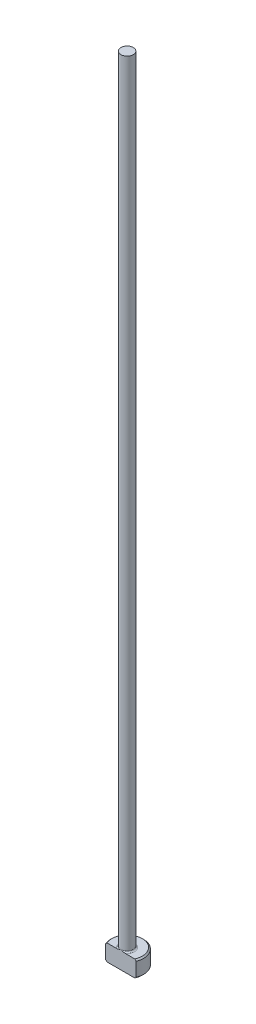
from build123d import *

# Parameters (mm, degrees)
CHAMFER1_SIZE = 0.254
FILLET1_R     = 0.254
KEY_DEPTH     = 153.466131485


with BuildPart() as part:
    # Sketch1 → Revolve1 (revolve)
    with BuildSketch(Plane.XY, mode=Mode.PRIVATE) as revolve1_sk:
        Polygon((0, 0), (-3.175, 0), (-3.175, 3.175), (-1.18999, 3.175), (-1.18999, 152.4), (0, 152.4), align=None)
    revolve(revolve1_sk.sketch.rotate(Axis((0, 259.958771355, 0), (0, -1, 0)), 270), axis=Axis((0, 259.958771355, 0), (0, -1, 0)))

    # Chamfer1
    chamfer1_edges = [part.edges().sort_by_distance(p)[0] for p in [
        (0, 3.175, -3.175),
        (0, 0, -3.175),
    ]]
    chamfer(chamfer1_edges, length=CHAMFER1_SIZE)

    # Fillet1
    fillet1_edges = [part.edges().sort_by_distance(p)[0] for p in [
        (0, 3.175, -1.18999),
    ]]
    fillet(fillet1_edges, radius=FILLET1_R)

    # Sketch2 → Key (cut, through all)
    with BuildSketch(Plane(origin=(0, 0, 0), x_dir=(1, 0, 0), z_dir=(0, 1, 0))):
        with BuildLine():
            Line((-2.943560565, -1.18999), (2.943560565, -1.18999))
            ThreePointArc((2.943560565, -1.18999), (0, -3.175), (-2.943560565, -1.18999))
        make_face()
    extrude(amount=KEY_DEPTH, mode=Mode.SUBTRACT)


solid = part.part
